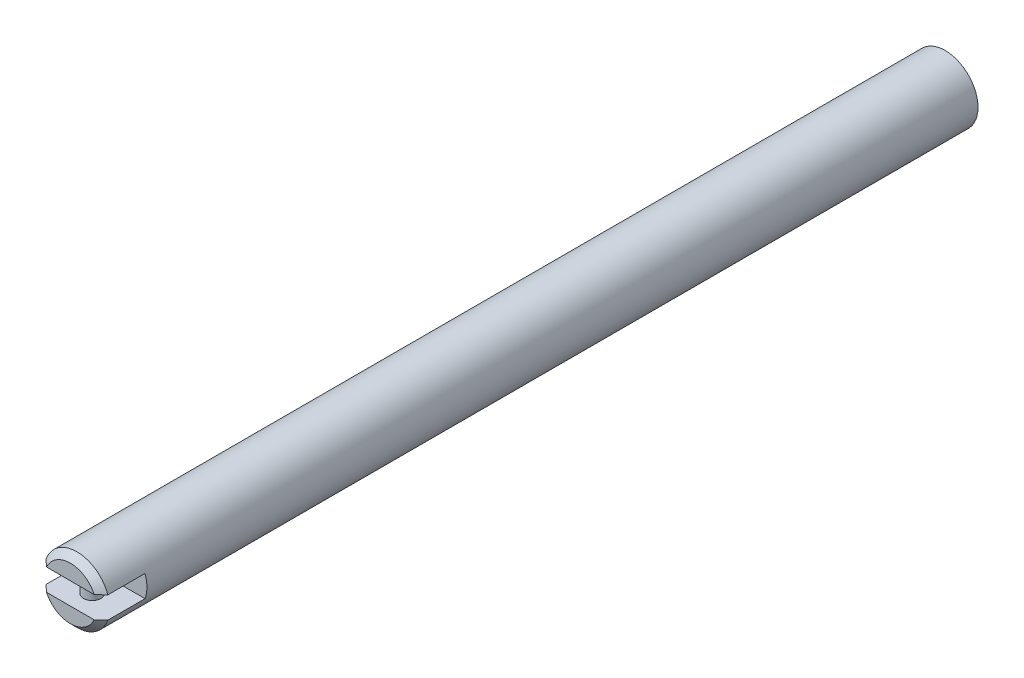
ISO-10303-21;
HEADER;
FILE_DESCRIPTION(('STEP AP214'),'2;1');
FILE_NAME('part.step','',(''),(''),'','','');
FILE_SCHEMA(('AUTOMOTIVE_DESIGN { 1 0 10303 214 1 1 1 1 }'));
ENDSEC;
DATA;
#1=APPLICATION_CONTEXT('core data for automotive mechanical design processes');
#2=APPLICATION_PROTOCOL_DEFINITION('international standard','automotive_design',2000,#1);
#3=PRODUCT_CONTEXT('',#1,'mechanical');
#4=PRODUCT('Part','Part','',(#3));
#5=PRODUCT_RELATED_PRODUCT_CATEGORY('part','',(#4));
#6=PRODUCT_DEFINITION_FORMATION('','',#4);
#7=PRODUCT_DEFINITION_CONTEXT('part definition',#1,'design');
#8=PRODUCT_DEFINITION('design','',#6,#7);
#9=PRODUCT_DEFINITION_SHAPE('','',#8);
#10=(LENGTH_UNIT() NAMED_UNIT(*) SI_UNIT(.MILLI.,.METRE.));
#11=(NAMED_UNIT(*) PLANE_ANGLE_UNIT() SI_UNIT($,.RADIAN.));
#12=(NAMED_UNIT(*) SI_UNIT($,.STERADIAN.) SOLID_ANGLE_UNIT());
#13=UNCERTAINTY_MEASURE_WITH_UNIT(LENGTH_MEASURE(1.E-05),#10,'distance_accuracy_value','');
#14=(GEOMETRIC_REPRESENTATION_CONTEXT(3) GLOBAL_UNCERTAINTY_ASSIGNED_CONTEXT((#13)) GLOBAL_UNIT_ASSIGNED_CONTEXT((#10,
#11,#12)) REPRESENTATION_CONTEXT('',''));
#15=CARTESIAN_POINT('',(0.,0.,0.));
#16=DIRECTION('',(0.,0.,1.));
#17=DIRECTION('',(1.,0.,0.));
#18=AXIS2_PLACEMENT_3D('',#15,#16,#17);
#19=CARTESIAN_POINT('',(-14.142135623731,-5.,380.));
#20=DIRECTION('',(0.,-1.,0.));
#21=DIRECTION('',(0.,0.,-1.));
#22=AXIS2_PLACEMENT_3D('',#19,#20,#21);
#23=PLANE('',#22);
#24=DIRECTION('',(1.,0.,0.));
#25=VECTOR('',#24,1.);
#26=CARTESIAN_POINT('',(-14.142135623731,-5.,400.));
#27=LINE('',#26,#25);
#28=CARTESIAN_POINT('',(-10.9087121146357,-5.,400.));
#29=VERTEX_POINT('',#28);
#30=CARTESIAN_POINT('',(10.9087121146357,-5.,400.));
#31=VERTEX_POINT('',#30);
#32=EDGE_CURVE('E106',#29,#31,#27,.T.);
#33=ORIENTED_EDGE('',*,*,#32,.T.);
#34=CARTESIAN_POINT('',(10.9087121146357,-5.,400.));
#35=CARTESIAN_POINT('',(11.1806899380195,-5.,399.752733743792));
#36=CARTESIAN_POINT('',(11.451889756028,-5.,399.504614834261));
#37=CARTESIAN_POINT('',(11.9929574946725,-5.,399.006939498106));
#38=CARTESIAN_POINT('',(12.2628254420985,-5.,398.757383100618));
#39=CARTESIAN_POINT('',(12.8014628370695,-5.,398.257092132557));
#40=CARTESIAN_POINT('',(13.0702322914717,-5.,398.006357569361));
#41=CARTESIAN_POINT('',(13.6068418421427,-5.,397.503884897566));
#42=CARTESIAN_POINT('',(13.8746819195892,-5.,397.252146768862));
#43=CARTESIAN_POINT('',(14.142135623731,-5.,397.));
#44=B_SPLINE_CURVE_WITH_KNOTS('',3,(#34,#35,#36,#37,#38,#39,#40,#41,#42,#43),.UNSPECIFIED.,.F.,
.F.,(4,2,2,2,4),(0.,1.10272491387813,2.20542755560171,3.30812330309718,4.41084125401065),.UNSPECIFIED.);
#45=CARTESIAN_POINT('',(14.142135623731,-5.,397.));
#46=VERTEX_POINT('',#45);
#47=EDGE_CURVE('E11',#31,#46,#44,.T.);
#48=ORIENTED_EDGE('',*,*,#47,.T.);
#49=DIRECTION('',(0.,0.,1.));
#50=VECTOR('',#49,1.);
#51=CARTESIAN_POINT('',(14.142135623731,-5.,380.));
#52=LINE('',#51,#50);
#53=CARTESIAN_POINT('',(14.142135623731,-5.,380.));
#54=VERTEX_POINT('',#53);
#55=EDGE_CURVE('E121',#54,#46,#52,.T.);
#56=ORIENTED_EDGE('',*,*,#55,.F.);
#57=DIRECTION('',(1.,0.,0.));
#58=VECTOR('',#57,1.);
#59=CARTESIAN_POINT('',(-14.142135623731,-5.,380.));
#60=LINE('',#59,#58);
#61=CARTESIAN_POINT('',(-14.142135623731,-5.,380.));
#62=VERTEX_POINT('',#61);
#63=EDGE_CURVE('E103',#62,#54,#60,.T.);
#64=ORIENTED_EDGE('',*,*,#63,.F.);
#65=DIRECTION('',(0.,0.,1.));
#66=VECTOR('',#65,1.);
#67=CARTESIAN_POINT('',(-14.142135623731,-5.,380.));
#68=LINE('',#67,#66);
#69=CARTESIAN_POINT('',(-14.142135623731,-5.,397.));
#70=VERTEX_POINT('',#69);
#71=EDGE_CURVE('E112',#62,#70,#68,.T.);
#72=ORIENTED_EDGE('',*,*,#71,.T.);
#73=CARTESIAN_POINT('',(-14.142135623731,-5.,397.));
#74=CARTESIAN_POINT('',(-13.8746819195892,-5.,397.252146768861));
#75=CARTESIAN_POINT('',(-13.6068418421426,-5.,397.503884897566));
#76=CARTESIAN_POINT('',(-13.0702322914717,-5.,398.006357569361));
#77=CARTESIAN_POINT('',(-12.8014628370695,-5.,398.257092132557));
#78=CARTESIAN_POINT('',(-12.2628254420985,-5.,398.757383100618));
#79=CARTESIAN_POINT('',(-11.9929574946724,-5.,399.006939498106));
#80=CARTESIAN_POINT('',(-11.451889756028,-5.,399.504614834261));
#81=CARTESIAN_POINT('',(-11.1806899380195,-5.,399.752733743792));
#82=CARTESIAN_POINT('',(-10.9087121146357,-5.,400.));
#83=B_SPLINE_CURVE_WITH_KNOTS('',3,(#73,#74,#75,#76,#77,#78,#79,#80,#81,#82),.UNSPECIFIED.,.F.,
.F.,(4,2,2,2,4),(0.,1.10271795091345,2.20541369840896,3.30811634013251,4.41084125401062),.UNSPECIFIED.);
#84=EDGE_CURVE('E39',#70,#29,#83,.T.);
#85=ORIENTED_EDGE('',*,*,#84,.T.);
#86=EDGE_LOOP('',(#33,#48,#56,#64,#72,#85));
#87=FACE_BOUND('',#86,.T.);
#88=CARTESIAN_POINT('',(0.,-5.,390.));
#89=DIRECTION('',(0.,-1.,0.));
#90=DIRECTION('',(0.,0.,-1.));
#91=AXIS2_PLACEMENT_3D('',#88,#89,#90);
#92=CIRCLE('',#91,4.);
#93=CARTESIAN_POINT('',(0.,-5.,386.));
#94=VERTEX_POINT('',#93);
#95=EDGE_CURVE('E124',#94,#94,#92,.F.);
#96=ORIENTED_EDGE('',*,*,#95,.F.);
#97=EDGE_LOOP('',(#96));
#98=FACE_BOUND('',#97,.T.);
#99=ADVANCED_FACE('F26',(#87,#98),#23,.F.);
#100=CARTESIAN_POINT('',(-14.142135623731,5.,380.));
#101=DIRECTION('',(0.,1.,0.));
#102=DIRECTION('',(0.,0.,1.));
#103=AXIS2_PLACEMENT_3D('',#100,#101,#102);
#104=PLANE('',#103);
#105=DIRECTION('',(-1.,0.,0.));
#106=VECTOR('',#105,1.);
#107=CARTESIAN_POINT('',(-14.142135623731,5.,400.));
#108=LINE('',#107,#106);
#109=CARTESIAN_POINT('',(10.9087121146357,5.,400.));
#110=VERTEX_POINT('',#109);
#111=CARTESIAN_POINT('',(-10.9087121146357,5.,400.));
#112=VERTEX_POINT('',#111);
#113=EDGE_CURVE('E225',#110,#112,#108,.T.);
#114=ORIENTED_EDGE('',*,*,#113,.T.);
#115=CARTESIAN_POINT('',(-10.9087121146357,5.,400.));
#116=CARTESIAN_POINT('',(-11.1806899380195,5.,399.752733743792));
#117=CARTESIAN_POINT('',(-11.451889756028,5.,399.504614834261));
#118=CARTESIAN_POINT('',(-11.9929574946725,5.,399.006939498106));
#119=CARTESIAN_POINT('',(-12.2628254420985,5.,398.757383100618));
#120=CARTESIAN_POINT('',(-12.8014628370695,5.,398.257092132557));
#121=CARTESIAN_POINT('',(-13.0702322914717,5.,398.006357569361));
#122=CARTESIAN_POINT('',(-13.6068418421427,5.,397.503884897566));
#123=CARTESIAN_POINT('',(-13.8746819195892,5.,397.252146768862));
#124=CARTESIAN_POINT('',(-14.142135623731,5.,397.));
#125=B_SPLINE_CURVE_WITH_KNOTS('',3,(#115,#116,#117,#118,#119,#120,#121,#122,#123,#124),
.UNSPECIFIED.,.F.,.F.,(4,2,2,2,4),(0.,1.10272491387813,2.20542755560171,3.30812330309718,
4.41084125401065),.UNSPECIFIED.);
#126=CARTESIAN_POINT('',(-14.142135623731,5.,397.));
#127=VERTEX_POINT('',#126);
#128=EDGE_CURVE('E137',#112,#127,#125,.T.);
#129=ORIENTED_EDGE('',*,*,#128,.T.);
#130=DIRECTION('',(0.,0.,1.));
#131=VECTOR('',#130,1.);
#132=CARTESIAN_POINT('',(-14.142135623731,5.,380.));
#133=LINE('',#132,#131);
#134=CARTESIAN_POINT('',(-14.142135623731,5.,380.));
#135=VERTEX_POINT('',#134);
#136=EDGE_CURVE('E93',#135,#127,#133,.T.);
#137=ORIENTED_EDGE('',*,*,#136,.F.);
#138=DIRECTION('',(-1.,0.,0.));
#139=VECTOR('',#138,1.);
#140=CARTESIAN_POINT('',(-14.142135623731,5.,380.));
#141=LINE('',#140,#139);
#142=CARTESIAN_POINT('',(14.142135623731,5.,380.));
#143=VERTEX_POINT('',#142);
#144=EDGE_CURVE('E84',#143,#135,#141,.T.);
#145=ORIENTED_EDGE('',*,*,#144,.F.);
#146=DIRECTION('',(0.,0.,1.));
#147=VECTOR('',#146,1.);
#148=CARTESIAN_POINT('',(14.142135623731,5.,380.));
#149=LINE('',#148,#147);
#150=CARTESIAN_POINT('',(14.142135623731,5.,397.));
#151=VERTEX_POINT('',#150);
#152=EDGE_CURVE('E90',#143,#151,#149,.T.);
#153=ORIENTED_EDGE('',*,*,#152,.T.);
#154=CARTESIAN_POINT('',(14.142135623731,5.,397.));
#155=CARTESIAN_POINT('',(13.8746819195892,5.,397.252146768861));
#156=CARTESIAN_POINT('',(13.6068418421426,5.,397.503884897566));
#157=CARTESIAN_POINT('',(13.0702322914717,5.,398.006357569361));
#158=CARTESIAN_POINT('',(12.8014628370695,5.,398.257092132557));
#159=CARTESIAN_POINT('',(12.2628254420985,5.,398.757383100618));
#160=CARTESIAN_POINT('',(11.9929574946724,5.,399.006939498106));
#161=CARTESIAN_POINT('',(11.451889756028,5.,399.504614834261));
#162=CARTESIAN_POINT('',(11.1806899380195,5.,399.752733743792));
#163=CARTESIAN_POINT('',(10.9087121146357,5.,400.));
#164=B_SPLINE_CURVE_WITH_KNOTS('',3,(#154,#155,#156,#157,#158,#159,#160,#161,#162,#163),
.UNSPECIFIED.,.F.,.F.,(4,2,2,2,4),(0.,1.10271795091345,2.20541369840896,3.30811634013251,
4.41084125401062),.UNSPECIFIED.);
#165=EDGE_CURVE('E130',#151,#110,#164,.T.);
#166=ORIENTED_EDGE('',*,*,#165,.T.);
#167=EDGE_LOOP('',(#114,#129,#137,#145,#153,#166));
#168=FACE_BOUND('',#167,.T.);
#169=CARTESIAN_POINT('',(0.,5.,390.));
#170=DIRECTION('',(0.,1.,0.));
#171=DIRECTION('',(0.,0.,1.));
#172=AXIS2_PLACEMENT_3D('',#169,#170,#171);
#173=CIRCLE('',#172,4.);
#174=CARTESIAN_POINT('',(0.,5.,394.));
#175=VERTEX_POINT('',#174);
#176=EDGE_CURVE('E120',#175,#175,#173,.F.);
#177=ORIENTED_EDGE('',*,*,#176,.F.);
#178=EDGE_LOOP('',(#177));
#179=FACE_BOUND('',#178,.T.);
#180=ADVANCED_FACE('F87',(#168,#179),#104,.F.);
#181=CARTESIAN_POINT('',(0.,0.,400.));
#182=DIRECTION('',(0.,0.,1.));
#183=DIRECTION('',(1.,0.,0.));
#184=AXIS2_PLACEMENT_3D('',#181,#182,#183);
#185=PLANE('',#184);
#186=ORIENTED_EDGE('',*,*,#32,.F.);
#187=CARTESIAN_POINT('',(0.,0.,400.));
#188=DIRECTION('',(0.,0.,1.));
#189=DIRECTION('',(1.,0.,0.));
#190=AXIS2_PLACEMENT_3D('',#187,#188,#189);
#191=CIRCLE('',#190,12.);
#192=EDGE_CURVE('E221',#29,#31,#191,.T.);
#193=ORIENTED_EDGE('',*,*,#192,.T.);
#194=EDGE_LOOP('',(#186,#193));
#195=FACE_BOUND('',#194,.T.);
#196=ADVANCED_FACE('F148',(#195),#185,.T.);
#197=CARTESIAN_POINT('',(0.,0.,400.));
#198=DIRECTION('',(0.,0.,-1.));
#199=DIRECTION('',(-1.,0.,0.));
#200=AXIS2_PLACEMENT_3D('',#197,#198,#199);
#201=CYLINDRICAL_SURFACE('',#200,15.);
#202=ORIENTED_EDGE('',*,*,#136,.T.);
#203=CARTESIAN_POINT('',(0.,0.,397.));
#204=DIRECTION('',(0.,0.,1.));
#205=DIRECTION('',(1.,0.,0.));
#206=AXIS2_PLACEMENT_3D('',#203,#204,#205);
#207=CIRCLE('',#206,15.);
#208=EDGE_CURVE('E110',#127,#151,#207,.F.);
#209=ORIENTED_EDGE('',*,*,#208,.T.);
#210=ORIENTED_EDGE('',*,*,#152,.F.);
#211=CARTESIAN_POINT('',(0.,0.,380.));
#212=DIRECTION('',(0.,0.,1.));
#213=DIRECTION('',(1.,0.,0.));
#214=AXIS2_PLACEMENT_3D('',#211,#212,#213);
#215=CIRCLE('',#214,15.);
#216=EDGE_CURVE('E97',#54,#143,#215,.T.);
#217=ORIENTED_EDGE('',*,*,#216,.F.);
#218=ORIENTED_EDGE('',*,*,#55,.T.);
#219=CARTESIAN_POINT('',(0.,0.,397.));
#220=DIRECTION('',(0.,0.,1.));
#221=DIRECTION('',(1.,0.,0.));
#222=AXIS2_PLACEMENT_3D('',#219,#220,#221);
#223=CIRCLE('',#222,15.);
#224=EDGE_CURVE('E223',#46,#70,#223,.F.);
#225=ORIENTED_EDGE('',*,*,#224,.T.);
#226=ORIENTED_EDGE('',*,*,#71,.F.);
#227=CARTESIAN_POINT('',(0.,0.,380.));
#228=DIRECTION('',(0.,0.,1.));
#229=DIRECTION('',(1.,0.,0.));
#230=AXIS2_PLACEMENT_3D('',#227,#228,#229);
#231=CIRCLE('',#230,15.);
#232=EDGE_CURVE('E96',#135,#62,#231,.T.);
#233=ORIENTED_EDGE('',*,*,#232,.F.);
#234=EDGE_LOOP('',(#202,#209,#210,#217,#218,#225,#226,#233));
#235=FACE_BOUND('',#234,.T.);
#236=CARTESIAN_POINT('',(0.,0.,0.));
#237=DIRECTION('',(0.,0.,1.));
#238=DIRECTION('',(1.,0.,0.));
#239=AXIS2_PLACEMENT_3D('',#236,#237,#238);
#240=CIRCLE('',#239,15.);
#241=CARTESIAN_POINT('',(15.,0.,0.));
#242=VERTEX_POINT('',#241);
#243=EDGE_CURVE('E117',#242,#242,#240,.T.);
#244=ORIENTED_EDGE('',*,*,#243,.T.);
#245=EDGE_LOOP('',(#244));
#246=FACE_BOUND('',#245,.T.);
#247=ADVANCED_FACE('F28',(#235,#246),#201,.T.);
#248=ORIENTED_EDGE('',*,*,#113,.F.);
#249=CARTESIAN_POINT('',(0.,0.,400.));
#250=DIRECTION('',(0.,0.,1.));
#251=DIRECTION('',(1.,0.,0.));
#252=AXIS2_PLACEMENT_3D('',#249,#250,#251);
#253=CIRCLE('',#252,12.);
#254=EDGE_CURVE('E127',#110,#112,#253,.T.);
#255=ORIENTED_EDGE('',*,*,#254,.T.);
#256=EDGE_LOOP('',(#248,#255));
#257=FACE_BOUND('',#256,.T.);
#258=ADVANCED_FACE('F154',(#257),#185,.T.);
#259=CARTESIAN_POINT('',(0.,0.,0.));
#260=DIRECTION('',(0.,0.,1.));
#261=DIRECTION('',(1.,0.,0.));
#262=AXIS2_PLACEMENT_3D('',#259,#260,#261);
#263=PLANE('',#262);
#264=ORIENTED_EDGE('',*,*,#243,.F.);
#265=EDGE_LOOP('',(#264));
#266=FACE_BOUND('',#265,.T.);
#267=ADVANCED_FACE('F151',(#266),#263,.F.);
#268=CARTESIAN_POINT('',(0.,0.,380.));
#269=DIRECTION('',(0.,0.,1.));
#270=DIRECTION('',(1.,0.,0.));
#271=AXIS2_PLACEMENT_3D('',#268,#269,#270);
#272=PLANE('',#271);
#273=ORIENTED_EDGE('',*,*,#216,.T.);
#274=ORIENTED_EDGE('',*,*,#144,.T.);
#275=ORIENTED_EDGE('',*,*,#232,.T.);
#276=ORIENTED_EDGE('',*,*,#63,.T.);
#277=EDGE_LOOP('',(#273,#274,#275,#276));
#278=FACE_BOUND('',#277,.T.);
#279=ADVANCED_FACE('F101',(#278),#272,.T.);
#280=CARTESIAN_POINT('',(0.,15.001,390.));
#281=DIRECTION('',(0.,-1.,0.));
#282=DIRECTION('',(0.,0.,-1.));
#283=AXIS2_PLACEMENT_3D('',#280,#281,#282);
#284=CYLINDRICAL_SURFACE('',#283,4.);
#285=ORIENTED_EDGE('',*,*,#95,.T.);
#286=EDGE_LOOP('',(#285));
#287=FACE_BOUND('',#286,.T.);
#288=ORIENTED_EDGE('',*,*,#176,.T.);
#289=EDGE_LOOP('',(#288));
#290=FACE_BOUND('',#289,.T.);
#291=ADVANCED_FACE('F172',(#287,#290),#284,.T.);
#292=CARTESIAN_POINT('',(0.,0.,400.));
#293=DIRECTION('',(0.,0.,-1.));
#294=DIRECTION('',(-1.,0.,0.));
#295=AXIS2_PLACEMENT_3D('',#292,#293,#294);
#296=CONICAL_SURFACE('',#295,12.,0.78539816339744);
#297=ORIENTED_EDGE('',*,*,#165,.F.);
#298=ORIENTED_EDGE('',*,*,#208,.F.);
#299=ORIENTED_EDGE('',*,*,#128,.F.);
#300=ORIENTED_EDGE('',*,*,#254,.F.);
#301=EDGE_LOOP('',(#297,#298,#299,#300));
#302=FACE_BOUND('',#301,.T.);
#303=ADVANCED_FACE('F142',(#302),#296,.T.);
#304=CARTESIAN_POINT('',(0.,0.,400.));
#305=DIRECTION('',(0.,0.,-1.));
#306=DIRECTION('',(-1.,0.,0.));
#307=AXIS2_PLACEMENT_3D('',#304,#305,#306);
#308=CONICAL_SURFACE('',#307,12.,0.78539816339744);
#309=ORIENTED_EDGE('',*,*,#84,.F.);
#310=ORIENTED_EDGE('',*,*,#224,.F.);
#311=ORIENTED_EDGE('',*,*,#47,.F.);
#312=ORIENTED_EDGE('',*,*,#192,.F.);
#313=EDGE_LOOP('',(#309,#310,#311,#312));
#314=FACE_BOUND('',#313,.T.);
#315=ADVANCED_FACE('F178',(#314),#308,.T.);
#316=CLOSED_SHELL('',(#99,#180,#196,#247,#258,#267,#279,#291,#303,#315));
#317=MANIFOLD_SOLID_BREP('B2',#316);
#318=ADVANCED_BREP_SHAPE_REPRESENTATION('',(#18,#317),#14);
#319=SHAPE_DEFINITION_REPRESENTATION(#9,#318);
ENDSEC;
END-ISO-10303-21;
